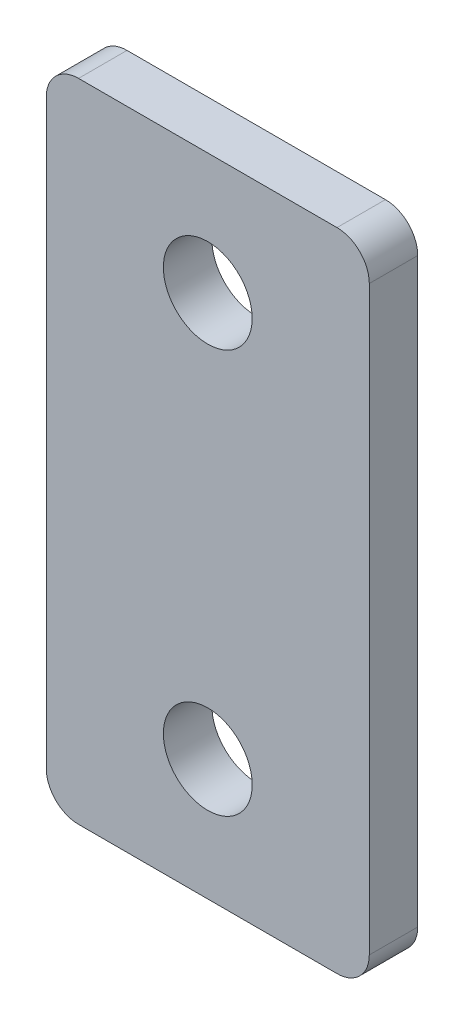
from build123d import *

# Parameters (mm, degrees)
ESQUISSE1_R          = 2.75
BASE_EXTRUSION_DEPTH = 3


with BuildPart() as part:
    # Esquisse1 → Base-Extrusion (new body)
    with BuildSketch(Plane.XY):
        with BuildLine():
            Line((2, 40), (18, 40))
            ThreePointArc((18, 40), (19.414213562, 39.414213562), (20, 38))
            Line((20, 38), (20, 2))
            ThreePointArc((20, 2), (19.414213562, 0.585786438), (18, 0))
            Line((18, 0), (2, 0))
            ThreePointArc((2, 0), (0.585786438, 0.585786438), (0, 2))
            Line((0, 2), (0, 38))
            ThreePointArc((0, 38), (0.585786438, 39.414213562), (2, 40))
        make_face()
        with Locations((10, 32.5)):
            Circle(ESQUISSE1_R, mode=Mode.SUBTRACT)
        with Locations((10, 7.5)):
            Circle(ESQUISSE1_R, mode=Mode.SUBTRACT)
    extrude(amount=BASE_EXTRUSION_DEPTH)


solid = part.part
